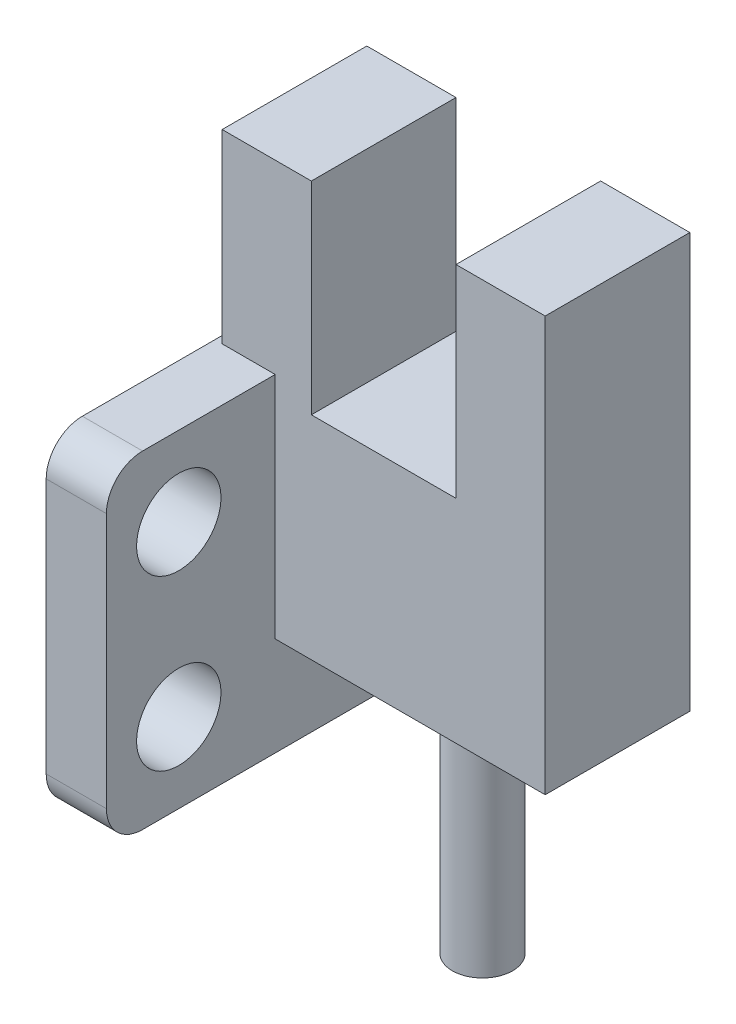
from build123d import *

# Parameters (mm, degrees)
EXTRUDE_1_DEPTH     = 6
EXTRUDE_2_DEPTH     = 2.2
SKETCH_3_W          = 13
SKETCH_3_H          = 13.6
EXTRUDE_3_DEPTH     = 0.3
SKETCH_4_R          = 1.75
CUT_EXTRUDE_1_DEPTH = 2.5
FILLET_2_R          = 1.5
SKETCH_5_R          = 1.25
EXTRUDE_4_DEPTH     = 10


with BuildPart() as part:
    # Sketch 1 → Extrude 1 (new body)
    with BuildSketch(Plane.XY):
        Polygon((0, 0), (0, 17.2), (3.7, 17.2), (3.7, 8.8), (9.7, 8.8), (9.7, 17.2), (13.4, 17.2), (13.4, 0), align=None)
    extrude(amount=EXTRUDE_1_DEPTH)

    # Sketch 2 → Extrude 2 (add)
    with BuildSketch(Plane.ZY):
        Polygon((0, 0), (0, -4.1), (13, -4.1), (13, 9.5), (0, 9.5), align=None)
    extrude(amount=-EXTRUDE_2_DEPTH)

    # Sketch 3 → Extrude 3 (add)
    with BuildSketch(Plane.ZY):
        with Locations((6.5, 2.7)):
            Rectangle(SKETCH_3_W, SKETCH_3_H)
    extrude(amount=EXTRUDE_3_DEPTH)

    # Sketch 4 → Cut-Extrude 1 (cut)
    with BuildSketch(Plane.ZY.offset(0.3)):
        with Locations((10, 6.2)):
            Circle(SKETCH_4_R)
        with Locations((10, -0.8)):
            Circle(SKETCH_4_R)
    extrude(amount=-CUT_EXTRUDE_1_DEPTH, mode=Mode.SUBTRACT)

    # Fillet 2
    fillet_2_edges = [part.edges().sort_by_distance(p)[0] for p in [
        (0.95, -4.1, 0),
        (0.95, 9.5, 13),
        (0.95, -4.1, 13),
    ]]
    fillet(fillet_2_edges, radius=FILLET_2_R)

    # Sketch 5 → Extrude 4 (add)
    with BuildSketch(Plane.XZ):
        with Locations(Location((7.8, 3, 0), (0, 0, 90))):
            Circle(SKETCH_5_R)
    extrude(amount=EXTRUDE_4_DEPTH)


solid = part.part
